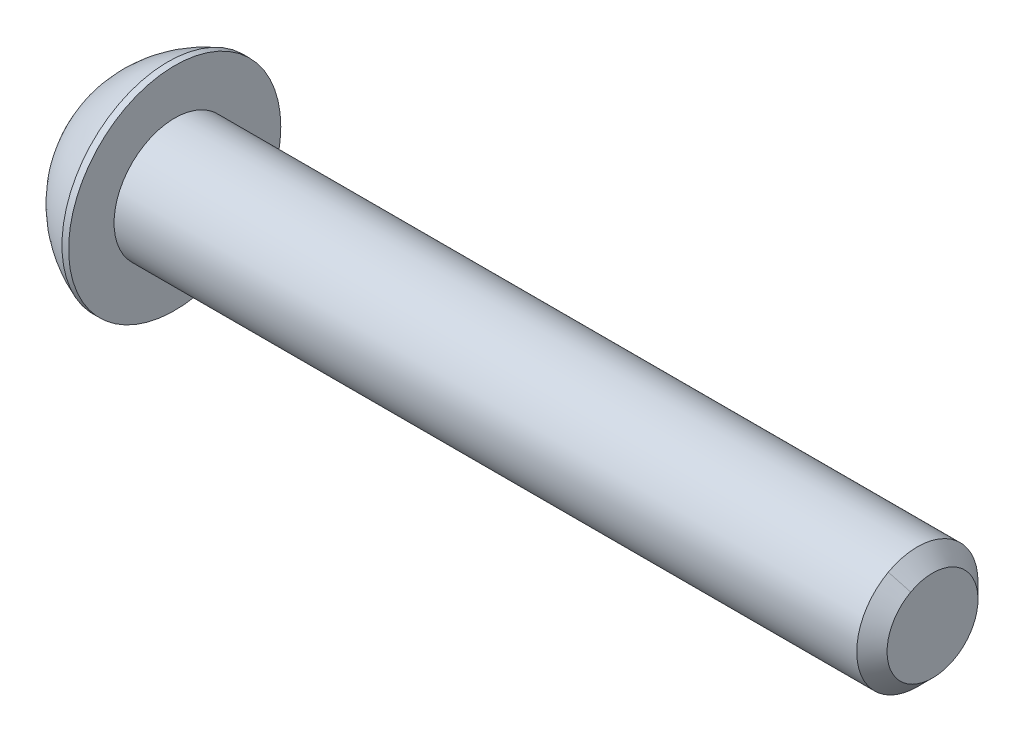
ISO-10303-21;
HEADER;
FILE_DESCRIPTION(('STEP AP214'),'2;1');
FILE_NAME('part.step','',(''),(''),'','','');
FILE_SCHEMA(('AUTOMOTIVE_DESIGN { 1 0 10303 214 1 1 1 1 }'));
ENDSEC;
DATA;
#1=APPLICATION_CONTEXT('core data for automotive mechanical design processes');
#2=APPLICATION_PROTOCOL_DEFINITION('international standard','automotive_design',2000,#1);
#3=PRODUCT_CONTEXT('',#1,'mechanical');
#4=PRODUCT('Part','Part','',(#3));
#5=PRODUCT_RELATED_PRODUCT_CATEGORY('part','',(#4));
#6=PRODUCT_DEFINITION_FORMATION('','',#4);
#7=PRODUCT_DEFINITION_CONTEXT('part definition',#1,'design');
#8=PRODUCT_DEFINITION('design','',#6,#7);
#9=PRODUCT_DEFINITION_SHAPE('','',#8);
#10=(LENGTH_UNIT() NAMED_UNIT(*) SI_UNIT(.MILLI.,.METRE.));
#11=(NAMED_UNIT(*) PLANE_ANGLE_UNIT() SI_UNIT($,.RADIAN.));
#12=(NAMED_UNIT(*) SI_UNIT($,.STERADIAN.) SOLID_ANGLE_UNIT());
#13=UNCERTAINTY_MEASURE_WITH_UNIT(LENGTH_MEASURE(1.E-05),#10,'distance_accuracy_value','');
#14=(GEOMETRIC_REPRESENTATION_CONTEXT(3) GLOBAL_UNCERTAINTY_ASSIGNED_CONTEXT((#13)) GLOBAL_UNIT_ASSIGNED_CONTEXT((#10,
#11,#12)) REPRESENTATION_CONTEXT('',''));
#15=CARTESIAN_POINT('',(0.,0.,0.));
#16=DIRECTION('',(0.,0.,1.));
#17=DIRECTION('',(1.,0.,0.));
#18=AXIS2_PLACEMENT_3D('',#15,#16,#17);
#19=CARTESIAN_POINT('',(-1.8,0.,0.));
#20=DIRECTION('',(1.,0.,0.));
#21=DIRECTION('',(0.,0.,-1.));
#22=AXIS2_PLACEMENT_3D('',#19,#20,#21);
#23=PLANE('',#22);
#24=DIRECTION('',(0.,-1.,0.));
#25=VECTOR('',#24,1.);
#26=CARTESIAN_POINT('',(-1.80000000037,0.,2.5));
#27=LINE('',#26,#25);
#28=CARTESIAN_POINT('',(-1.8000000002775,-1.44337567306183,2.49999999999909));
#29=VERTEX_POINT('',#28);
#30=CARTESIAN_POINT('',(-1.800000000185,1.44337567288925,2.50000000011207));
#31=VERTEX_POINT('',#30);
#32=EDGE_CURVE('P0_E102',#29,#31,#27,.F.);
#33=ORIENTED_EDGE('',*,*,#32,.T.);
#34=DIRECTION('',(0.,-0.50000000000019,0.866025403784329));
#35=VECTOR('',#34,1.);
#36=CARTESIAN_POINT('',(-1.80000000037,2.16506350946,1.25));
#37=LINE('',#36,#35);
#38=CARTESIAN_POINT('',(-1.800000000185,2.88675134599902,1.29572266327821E-10));
#39=VERTEX_POINT('',#38);
#40=EDGE_CURVE('P0_E97',#31,#39,#37,.F.);
#41=ORIENTED_EDGE('',*,*,#40,.T.);
#42=DIRECTION('',(0.,0.50000000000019,0.866025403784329));
#43=VECTOR('',#42,1.);
#44=CARTESIAN_POINT('',(-1.80000000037,2.16506350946,-1.25));
#45=LINE('',#44,#43);
#46=CARTESIAN_POINT('',(-1.800000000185,1.44337567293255,-2.50000000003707));
#47=VERTEX_POINT('',#46);
#48=EDGE_CURVE('P0_E93',#39,#47,#45,.F.);
#49=ORIENTED_EDGE('',*,*,#48,.T.);
#50=DIRECTION('',(0.,1.,0.));
#51=VECTOR('',#50,1.);
#52=CARTESIAN_POINT('',(-1.80000000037,0.,-2.5));
#53=LINE('',#52,#51);
#54=CARTESIAN_POINT('',(-1.800000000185,-1.44337567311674,-2.4999999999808));
#55=VERTEX_POINT('',#54);
#56=EDGE_CURVE('P0_E66',#47,#55,#53,.F.);
#57=ORIENTED_EDGE('',*,*,#56,.T.);
#58=DIRECTION('',(0.,0.50000000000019,-0.866025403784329));
#59=VECTOR('',#58,1.);
#60=CARTESIAN_POINT('',(-1.80000000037,-2.16506350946,-1.25));
#61=LINE('',#60,#59);
#62=CARTESIAN_POINT('',(-1.800000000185,-2.88675134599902,-1.29572861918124E-10));
#63=VERTEX_POINT('',#62);
#64=EDGE_CURVE('P0_E68',#55,#63,#61,.F.);
#65=ORIENTED_EDGE('',*,*,#64,.T.);
#66=DIRECTION('',(0.,-0.50000000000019,-0.866025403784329));
#67=VECTOR('',#66,1.);
#68=CARTESIAN_POINT('',(-1.80000000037,-2.16506350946,1.25));
#69=LINE('',#68,#67);
#70=EDGE_CURVE('P0_E70',#63,#29,#69,.F.);
#71=ORIENTED_EDGE('',*,*,#70,.T.);
#72=EDGE_LOOP('',(#33,#41,#49,#57,#65,#71));
#73=FACE_BOUND('',#72,.T.);
#74=ADVANCED_FACE('P0_F16',(#73),#23,.F.);
#75=CARTESIAN_POINT('',(-5.4,-2.16506350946,1.25));
#76=DIRECTION('',(0.,-0.866025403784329,0.50000000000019));
#77=DIRECTION('',(0.,-0.50000000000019,-0.866025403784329));
#78=AXIS2_PLACEMENT_3D('',#75,#76,#77);
#79=PLANE('',#78);
#80=DIRECTION('',(1.,0.,0.));
#81=VECTOR('',#80,1.);
#82=CARTESIAN_POINT('',(-5.4,-1.44337567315,2.5));
#83=LINE('',#82,#81);
#84=CARTESIAN_POINT('',(-4.4,-1.44337567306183,2.49999999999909));
#85=VERTEX_POINT('',#84);
#86=EDGE_CURVE('P0_E81',#85,#29,#83,.T.);
#87=ORIENTED_EDGE('',*,*,#86,.T.);
#88=ORIENTED_EDGE('',*,*,#70,.F.);
#89=DIRECTION('',(1.,0.,0.));
#90=VECTOR('',#89,1.);
#91=CARTESIAN_POINT('',(-5.4,-2.88675134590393,-7.52941545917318E-11));
#92=LINE('',#91,#90);
#93=CARTESIAN_POINT('',(-4.4,-2.88675134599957,-1.292594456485E-10));
#94=VERTEX_POINT('',#93);
#95=EDGE_CURVE('P0_E75',#63,#94,#92,.F.);
#96=ORIENTED_EDGE('',*,*,#95,.T.);
#97=DIRECTION('',(0.,-0.499999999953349,-0.866025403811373));
#98=VECTOR('',#97,1.);
#99=CARTESIAN_POINT('',(-4.4,-1.44337567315,2.5));
#100=LINE('',#99,#98);
#101=EDGE_CURVE('P0_E105',#85,#94,#100,.T.);
#102=ORIENTED_EDGE('',*,*,#101,.F.);
#103=EDGE_LOOP('',(#87,#88,#96,#102));
#104=FACE_BOUND('',#103,.T.);
#105=ADVANCED_FACE('P0_F78',(#104),#79,.F.);
#106=CARTESIAN_POINT('',(-5.4,-2.16506350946,-1.25));
#107=DIRECTION('',(0.,-0.866025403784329,-0.50000000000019));
#108=DIRECTION('',(0.,0.50000000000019,-0.866025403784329));
#109=AXIS2_PLACEMENT_3D('',#106,#107,#108);
#110=PLANE('',#109);
#111=ORIENTED_EDGE('',*,*,#95,.F.);
#112=ORIENTED_EDGE('',*,*,#64,.F.);
#113=DIRECTION('',(-1.,0.,0.));
#114=VECTOR('',#113,1.);
#115=CARTESIAN_POINT('',(-5.4,-1.44337567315,-2.5));
#116=LINE('',#115,#114);
#117=CARTESIAN_POINT('',(-4.4,-1.44337567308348,-2.49999999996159));
#118=VERTEX_POINT('',#117);
#119=EDGE_CURVE('P0_E89',#55,#118,#116,.T.);
#120=ORIENTED_EDGE('',*,*,#119,.T.);
#121=DIRECTION('',(0.,0.499999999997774,-0.866025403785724));
#122=VECTOR('',#121,1.);
#123=CARTESIAN_POINT('',(-4.4,-2.88675134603,-1.48083101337E-10));
#124=LINE('',#123,#122);
#125=EDGE_CURVE('P0_E86',#94,#118,#124,.T.);
#126=ORIENTED_EDGE('',*,*,#125,.F.);
#127=EDGE_LOOP('',(#111,#112,#120,#126));
#128=FACE_BOUND('',#127,.T.);
#129=ADVANCED_FACE('P0_F84',(#128),#110,.F.);
#130=CARTESIAN_POINT('',(-5.4,0.,-2.5));
#131=DIRECTION('',(0.,0.,-1.));
#132=DIRECTION('',(-1.,0.,0.));
#133=AXIS2_PLACEMENT_3D('',#130,#131,#132);
#134=PLANE('',#133);
#135=ORIENTED_EDGE('',*,*,#119,.F.);
#136=ORIENTED_EDGE('',*,*,#56,.F.);
#137=DIRECTION('',(1.,0.,0.));
#138=VECTOR('',#137,1.);
#139=CARTESIAN_POINT('',(-5.4,1.443375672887,-2.50000000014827));
#140=LINE('',#139,#138);
#141=CARTESIAN_POINT('',(-4.4,1.4433756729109,-2.50000000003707));
#142=VERTEX_POINT('',#141);
#143=EDGE_CURVE('P0_E95',#47,#142,#140,.F.);
#144=ORIENTED_EDGE('',*,*,#143,.T.);
#145=DIRECTION('',(0.,-1.,0.));
#146=VECTOR('',#145,1.);
#147=CARTESIAN_POINT('',(-4.4,1.925,-2.5));
#148=LINE('',#147,#146);
#149=EDGE_CURVE('P0_E108',#118,#142,#148,.F.);
#150=ORIENTED_EDGE('',*,*,#149,.F.);
#151=EDGE_LOOP('',(#135,#136,#144,#150));
#152=FACE_BOUND('',#151,.T.);
#153=ADVANCED_FACE('P0_F193',(#152),#134,.F.);
#154=CARTESIAN_POINT('',(-5.4,2.16506350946,-1.25));
#155=DIRECTION('',(0.,0.866025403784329,-0.50000000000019));
#156=DIRECTION('',(0.,0.50000000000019,0.866025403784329));
#157=AXIS2_PLACEMENT_3D('',#154,#155,#156);
#158=PLANE('',#157);
#159=ORIENTED_EDGE('',*,*,#143,.F.);
#160=ORIENTED_EDGE('',*,*,#48,.F.);
#161=DIRECTION('',(1.,0.,0.));
#162=VECTOR('',#161,1.);
#163=CARTESIAN_POINT('',(-5.4,2.88675134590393,7.52939377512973E-11));
#164=LINE('',#163,#162);
#165=CARTESIAN_POINT('',(-4.4,2.88675134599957,1.29259136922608E-10));
#166=VERTEX_POINT('',#165);
#167=EDGE_CURVE('P0_E99',#39,#166,#164,.F.);
#168=ORIENTED_EDGE('',*,*,#167,.T.);
#169=DIRECTION('',(0.,0.499999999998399,0.866025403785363));
#170=VECTOR('',#169,1.);
#171=CARTESIAN_POINT('',(-4.4,1.44337567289,-2.50000000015));
#172=LINE('',#171,#170);
#173=EDGE_CURVE('P0_E111',#142,#166,#172,.T.);
#174=ORIENTED_EDGE('',*,*,#173,.F.);
#175=EDGE_LOOP('',(#159,#160,#168,#174));
#176=FACE_BOUND('',#175,.T.);
#177=ADVANCED_FACE('P0_F184',(#176),#158,.F.);
#178=CARTESIAN_POINT('',(-5.4,2.16506350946,1.25));
#179=DIRECTION('',(0.,0.866025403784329,0.50000000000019));
#180=DIRECTION('',(0.,-0.50000000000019,0.866025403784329));
#181=AXIS2_PLACEMENT_3D('',#178,#179,#180);
#182=PLANE('',#181);
#183=ORIENTED_EDGE('',*,*,#167,.F.);
#184=ORIENTED_EDGE('',*,*,#40,.F.);
#185=DIRECTION('',(1.,0.,0.));
#186=VECTOR('',#185,1.);
#187=CARTESIAN_POINT('',(-5.4,1.44337567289,2.5));
#188=LINE('',#187,#186);
#189=CARTESIAN_POINT('',(-4.4,1.4433756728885,2.50000000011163));
#190=VERTEX_POINT('',#189);
#191=EDGE_CURVE('P0_E33',#31,#190,#188,.F.);
#192=ORIENTED_EDGE('',*,*,#191,.T.);
#193=DIRECTION('',(0.,-0.500000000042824,0.866025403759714));
#194=VECTOR('',#193,1.);
#195=CARTESIAN_POINT('',(-4.4,2.88675134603,1.48082879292E-10));
#196=LINE('',#195,#194);
#197=EDGE_CURVE('P0_E114',#166,#190,#196,.T.);
#198=ORIENTED_EDGE('',*,*,#197,.F.);
#199=EDGE_LOOP('',(#183,#184,#192,#198));
#200=FACE_BOUND('',#199,.T.);
#201=ADVANCED_FACE('P0_F141',(#200),#182,.F.);
#202=CARTESIAN_POINT('',(-5.4,0.,2.5));
#203=DIRECTION('',(0.,0.,1.));
#204=DIRECTION('',(0.,-1.,0.));
#205=AXIS2_PLACEMENT_3D('',#202,#203,#204);
#206=PLANE('',#205);
#207=ORIENTED_EDGE('',*,*,#191,.F.);
#208=ORIENTED_EDGE('',*,*,#32,.F.);
#209=ORIENTED_EDGE('',*,*,#86,.F.);
#210=DIRECTION('',(0.,-1.,0.));
#211=VECTOR('',#210,1.);
#212=CARTESIAN_POINT('',(-4.4,1.925,2.50000000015));
#213=LINE('',#212,#211);
#214=EDGE_CURVE('P0_E117',#190,#85,#213,.T.);
#215=ORIENTED_EDGE('',*,*,#214,.F.);
#216=EDGE_LOOP('',(#207,#208,#209,#215));
#217=FACE_BOUND('',#216,.T.);
#218=ADVANCED_FACE('P0_F130',(#217),#206,.F.);
#219=CARTESIAN_POINT('',(-4.4,1.925,0.));
#220=DIRECTION('',(-1.,0.,0.));
#221=DIRECTION('',(0.,-1.,0.));
#222=AXIS2_PLACEMENT_3D('',#219,#220,#221);
#223=PLANE('',#222);
#224=ORIENTED_EDGE('',*,*,#197,.T.);
#225=ORIENTED_EDGE('',*,*,#214,.T.);
#226=ORIENTED_EDGE('',*,*,#101,.T.);
#227=ORIENTED_EDGE('',*,*,#125,.T.);
#228=ORIENTED_EDGE('',*,*,#149,.T.);
#229=ORIENTED_EDGE('',*,*,#173,.T.);
#230=EDGE_LOOP('',(#224,#225,#226,#227,#228,#229));
#231=FACE_BOUND('',#230,.T.);
#232=CARTESIAN_POINT('',(-4.39999999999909,0.,0.));
#233=DIRECTION('',(1.,0.,0.));
#234=DIRECTION('',(0.,0.,-1.));
#235=AXIS2_PLACEMENT_3D('',#232,#233,#234);
#236=CIRCLE('',#235,3.84999999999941);
#237=CARTESIAN_POINT('',(-4.39999999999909,0.,-3.84999999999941));
#238=VERTEX_POINT('',#237);
#239=EDGE_CURVE('P0_E19',#238,#238,#236,.T.);
#240=ORIENTED_EDGE('',*,*,#239,.F.);
#241=EDGE_LOOP('',(#240));
#242=FACE_BOUND('',#241,.T.);
#243=ADVANCED_FACE('P0_F128',(#231,#242),#223,.T.);
#244=CARTESIAN_POINT('',(2.27175799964,0.,0.));
#245=DIRECTION('',(1.,0.,0.));
#246=DIRECTION('',(0.,0.,1.));
#247=AXIS2_PLACEMENT_3D('',#244,#245,#246);
#248=DEGENERATE_TOROIDAL_SURFACE('',#247,0.473210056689,7.95,.F.);
#249=CARTESIAN_POINT('',(-0.440000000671,0.,0.));
#250=DIRECTION('',(1.,0.,0.));
#251=DIRECTION('',(0.,0.,-1.));
#252=AXIS2_PLACEMENT_3D('',#249,#250,#251);
#253=CIRCLE('',#252,7.);
#254=CARTESIAN_POINT('',(-0.440000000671,0.,-7.));
#255=VERTEX_POINT('',#254);
#256=EDGE_CURVE('P0_E25',#255,#255,#253,.T.);
#257=ORIENTED_EDGE('',*,*,#256,.F.);
#258=EDGE_LOOP('',(#257));
#259=FACE_BOUND('',#258,.T.);
#260=ORIENTED_EDGE('',*,*,#239,.T.);
#261=EDGE_LOOP('',(#260));
#262=FACE_BOUND('',#261,.T.);
#263=ADVANCED_FACE('P0_F126',(#259,#262),#248,.F.);
#264=CARTESIAN_POINT('',(-0.22,0.,0.));
#265=DIRECTION('',(1.,0.,0.));
#266=DIRECTION('',(0.,0.,-1.));
#267=AXIS2_PLACEMENT_3D('',#264,#265,#266);
#268=CYLINDRICAL_SURFACE('',#267,7.);
#269=ORIENTED_EDGE('',*,*,#256,.T.);
#270=EDGE_LOOP('',(#269));
#271=FACE_BOUND('',#270,.T.);
#272=CARTESIAN_POINT('',(6.70551261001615E-10,0.,0.));
#273=DIRECTION('',(1.,0.,0.));
#274=DIRECTION('',(0.,0.,-1.));
#275=AXIS2_PLACEMENT_3D('',#272,#273,#274);
#276=CIRCLE('',#275,7.);
#277=CARTESIAN_POINT('',(6.70551261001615E-10,0.,-7.));
#278=VERTEX_POINT('',#277);
#279=EDGE_CURVE('P0_E11',#278,#278,#276,.T.);
#280=ORIENTED_EDGE('',*,*,#279,.F.);
#281=EDGE_LOOP('',(#280));
#282=FACE_BOUND('',#281,.T.);
#283=ADVANCED_FACE('P0_F138',(#271,#282),#268,.T.);
#284=CARTESIAN_POINT('',(0.,5.7,0.));
#285=DIRECTION('',(1.,0.,0.));
#286=DIRECTION('',(0.,0.,-1.));
#287=AXIS2_PLACEMENT_3D('',#284,#285,#286);
#288=PLANE('',#287);
#289=ORIENTED_EDGE('',*,*,#279,.T.);
#290=EDGE_LOOP('',(#289));
#291=FACE_BOUND('',#290,.T.);
#292=ADVANCED_FACE('P0_F144',(#291),#288,.T.);
#293=CLOSED_SHELL('',(#74,#105,#129,#153,#177,#201,#218,#243,#263,#283,#292));
#294=MANIFOLD_SOLID_BREP('P0_B1',#293);
#295=CARTESIAN_POINT('',(49.0000000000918,0.,0.));
#296=DIRECTION('',(-1.,0.,0.));
#297=DIRECTION('',(0.,-1.,0.));
#298=AXIS2_PLACEMENT_3D('',#295,#296,#297);
#299=CONICAL_SURFACE('',#298,3.99999999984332,0.785398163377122);
#300=CARTESIAN_POINT('',(48.999999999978,-3.51033024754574,-1.91770215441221));
#301=CARTESIAN_POINT('',(49.0416666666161,-3.47376430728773,-1.8977260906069));
#302=CARTESIAN_POINT('',(49.0833333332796,-3.43719836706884,-1.87775002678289));
#303=CARTESIAN_POINT('',(49.1666666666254,-3.36406648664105,-1.83779789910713));
#304=CARTESIAN_POINT('',(49.2083333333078,-3.32750054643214,-1.81782183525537));
#305=CARTESIAN_POINT('',(49.2916666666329,-3.25436866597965,-1.7778697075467));
#306=CARTESIAN_POINT('',(49.3333333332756,-3.21780272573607,-1.75789364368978));
#307=CARTESIAN_POINT('',(49.4166666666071,-3.14467084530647,-1.71794151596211));
#308=CARTESIAN_POINT('',(49.4583333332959,-3.10810490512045,-1.69796545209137));
#309=CARTESIAN_POINT('',(49.5416666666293,-3.03497302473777,-1.65801332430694));
#310=CARTESIAN_POINT('',(49.5833333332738,-2.99840708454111,-1.63803726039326));
#311=CARTESIAN_POINT('',(49.6666666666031,-2.9252752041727,-1.59808513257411));
#312=CARTESIAN_POINT('',(49.7083333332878,-2.88870926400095,-1.57810906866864));
#313=CARTESIAN_POINT('',(49.7916666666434,-2.815577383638,-1.53815694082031));
#314=CARTESIAN_POINT('',(49.8333333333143,-2.7790114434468,-1.51818087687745));
#315=CARTESIAN_POINT('',(49.9166666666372,-2.70587956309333,-1.47822874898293));
#316=CARTESIAN_POINT('',(49.9583333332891,-2.66931362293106,-1.45825268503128));
#317=CARTESIAN_POINT('',(49.9999999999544,-2.63274768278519,-1.43827662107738));
#318=B_SPLINE_CURVE_WITH_KNOTS('',3,(#300,#301,#302,#303,#304,#305,#306,#307,#308,#309,#310,
#311,#312,#313,#314,#315,#316,#317),.UNSPECIFIED.,.F.,.F.,(4,2,2,2,2,2,2,2,4),(0.,
0.176776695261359,0.353553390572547,0.53033008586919,0.707106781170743,0.883883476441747,
1.0606601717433,1.23743686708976,1.41421356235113),.UNSPECIFIED.);
#319=CARTESIAN_POINT('',(48.9999999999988,-3.51033024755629,-1.91770215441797));
#320=VERTEX_POINT('',#319);
#321=CARTESIAN_POINT('',(49.9999999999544,-2.63274768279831,-1.43827662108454));
#322=VERTEX_POINT('',#321);
#323=EDGE_CURVE('P1_E43',#320,#322,#318,.T.);
#324=ORIENTED_EDGE('',*,*,#323,.T.);
#325=CARTESIAN_POINT('',(49.9999999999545,0.,0.));
#326=DIRECTION('',(-1.,0.,0.));
#327=DIRECTION('',(0.,-1.,0.));
#328=AXIS2_PLACEMENT_3D('',#325,#326,#327);
#329=CIRCLE('',#328,3.00000000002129);
#330=CARTESIAN_POINT('',(49.9999999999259,2.63274768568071,1.43827661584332));
#331=VERTEX_POINT('',#330);
#332=EDGE_CURVE('P1_E19',#331,#322,#329,.F.);
#333=ORIENTED_EDGE('',*,*,#332,.F.);
#334=DIRECTION('',(0.70710678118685,-0.620544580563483,-0.339005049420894));
#335=VECTOR('',#334,1.);
#336=CARTESIAN_POINT('',(-499000.,437960.210258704,239258.753316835));
#337=LINE('',#336,#335);
#338=CARTESIAN_POINT('',(49.0000000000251,3.51033024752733,1.91770215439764));
#339=VERTEX_POINT('',#338);
#340=EDGE_CURVE('P1_E34',#331,#339,#337,.F.);
#341=ORIENTED_EDGE('',*,*,#340,.T.);
#342=CARTESIAN_POINT('',(49.,0.,0.));
#343=DIRECTION('',(1.,0.,0.));
#344=DIRECTION('',(0.,0.,-1.));
#345=AXIS2_PLACEMENT_3D('',#342,#343,#344);
#346=CIRCLE('',#345,4.);
#347=EDGE_CURVE('P1_E46',#320,#339,#346,.F.);
#348=ORIENTED_EDGE('',*,*,#347,.F.);
#349=EDGE_LOOP('',(#324,#333,#341,#348));
#350=FACE_BOUND('',#349,.T.);
#351=ADVANCED_FACE('P1_F16',(#350),#299,.T.);
#352=CARTESIAN_POINT('',(50.,0.,0.));
#353=DIRECTION('',(1.,0.,0.));
#354=DIRECTION('',(0.,0.,-1.));
#355=AXIS2_PLACEMENT_3D('',#352,#353,#354);
#356=PLANE('',#355);
#357=ORIENTED_EDGE('',*,*,#332,.T.);
#358=CARTESIAN_POINT('',(50.000000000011,1.11719633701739E-13,-1.5084499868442E-13));
#359=DIRECTION('',(-1.,-1.11719633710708E-13,1.5084499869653E-13));
#360=DIRECTION('',(1.5084499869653E-13,0.,1.));
#361=AXIS2_PLACEMENT_3D('',#358,#359,#360);
#362=CIRCLE('',#361,3.00000000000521);
#363=EDGE_CURVE('P1_E50',#331,#322,#362,.T.);
#364=ORIENTED_EDGE('',*,*,#363,.F.);
#365=EDGE_LOOP('',(#357,#364));
#366=FACE_BOUND('',#365,.T.);
#367=ADVANCED_FACE('P1_F49',(#366),#356,.T.);
#368=CARTESIAN_POINT('',(0.,4.,0.));
#369=DIRECTION('',(1.,0.,0.));
#370=DIRECTION('',(0.,0.,-1.));
#371=AXIS2_PLACEMENT_3D('',#368,#369,#370);
#372=PLANE('',#371);
#373=CARTESIAN_POINT('',(0.,0.,0.));
#374=DIRECTION('',(1.,0.,0.));
#375=DIRECTION('',(0.,0.,-1.));
#376=AXIS2_PLACEMENT_3D('',#373,#374,#375);
#377=CIRCLE('',#376,4.);
#378=CARTESIAN_POINT('',(0.,0.,-4.));
#379=VERTEX_POINT('',#378);
#380=EDGE_CURVE('P1_E25',#379,#379,#377,.T.);
#381=ORIENTED_EDGE('',*,*,#380,.F.);
#382=EDGE_LOOP('',(#381));
#383=FACE_BOUND('',#382,.T.);
#384=ADVANCED_FACE('P1_F76',(#383),#372,.F.);
#385=CARTESIAN_POINT('',(49.0000000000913,0.,0.));
#386=DIRECTION('',(-1.,-1.11719633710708E-13,1.5084499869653E-13));
#387=DIRECTION('',(1.5084499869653E-13,0.,1.));
#388=AXIS2_PLACEMENT_3D('',#385,#386,#387);
#389=CONICAL_SURFACE('',#388,3.99999999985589,0.785398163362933);
#390=ORIENTED_EDGE('',*,*,#340,.F.);
#391=ORIENTED_EDGE('',*,*,#363,.T.);
#392=ORIENTED_EDGE('',*,*,#323,.F.);
#393=CARTESIAN_POINT('',(49.,0.,0.));
#394=DIRECTION('',(1.,0.,0.));
#395=DIRECTION('',(0.,0.,-1.));
#396=AXIS2_PLACEMENT_3D('',#393,#394,#395);
#397=CIRCLE('',#396,4.);
#398=EDGE_CURVE('P1_E11',#339,#320,#397,.F.);
#399=ORIENTED_EDGE('',*,*,#398,.F.);
#400=EDGE_LOOP('',(#390,#391,#392,#399));
#401=FACE_BOUND('',#400,.T.);
#402=ADVANCED_FACE('P1_F51',(#401),#389,.T.);
#403=CARTESIAN_POINT('',(25.,0.,0.));
#404=DIRECTION('',(1.,0.,0.));
#405=DIRECTION('',(0.,0.,-1.));
#406=AXIS2_PLACEMENT_3D('',#403,#404,#405);
#407=CYLINDRICAL_SURFACE('',#406,4.);
#408=ORIENTED_EDGE('',*,*,#380,.T.);
#409=EDGE_LOOP('',(#408));
#410=FACE_BOUND('',#409,.T.);
#411=ORIENTED_EDGE('',*,*,#398,.T.);
#412=ORIENTED_EDGE('',*,*,#347,.T.);
#413=EDGE_LOOP('',(#411,#412));
#414=FACE_BOUND('',#413,.T.);
#415=ADVANCED_FACE('P1_F82',(#410,#414),#407,.T.);
#416=CLOSED_SHELL('',(#351,#367,#384,#402,#415));
#417=MANIFOLD_SOLID_BREP('P1_B1',#416);
#418=ADVANCED_BREP_SHAPE_REPRESENTATION('',(#18,#294,#417),#14);
#419=SHAPE_DEFINITION_REPRESENTATION(#9,#418);
ENDSEC;
END-ISO-10303-21;
